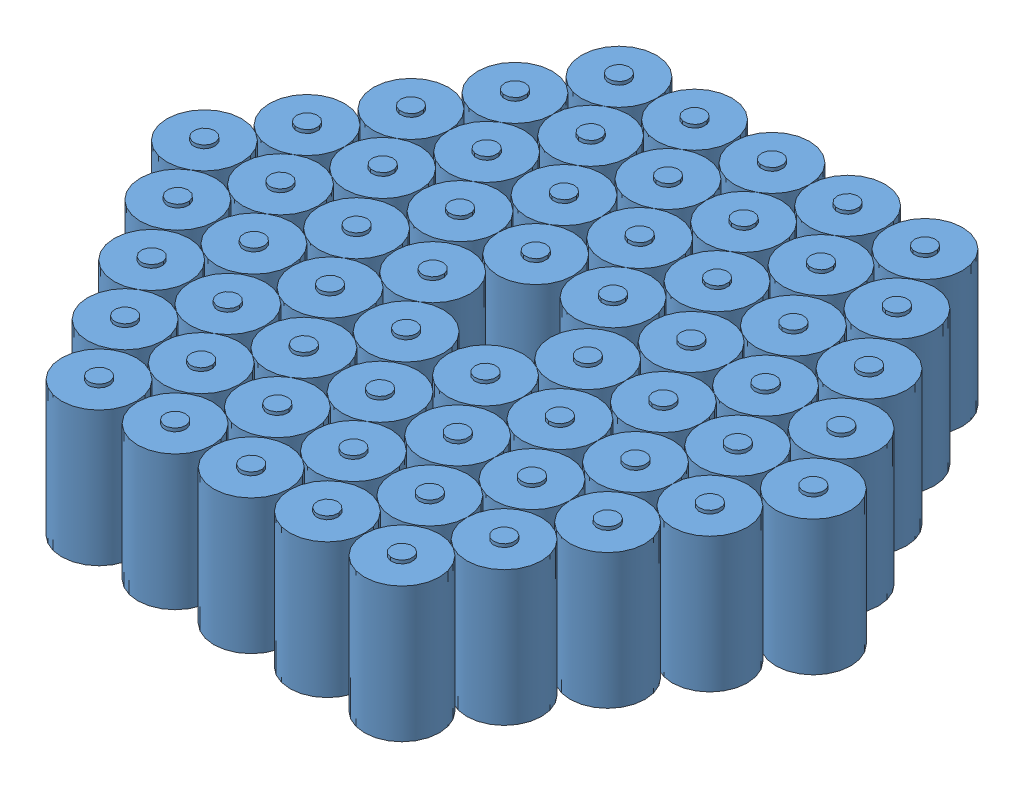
SolidWorks assembly MX1300 60 pack.SLDASM, configuration Default (file format 5000). Lengths in mm.
Overall size (352.05 63 346.25).
78 component instances, 1 part files, 11 mates.
Components (placement in the parent):
- MX1300 20 pack-1: MX1300 20 pack.SLDASM [Default] at (151.7205 0 -357.6328) x (0.5 0 -0.866025) z (0.866025 0 0.5) size (208.75 63 152.66)
  - MX1300 4 pack-1: MX1300 4 pack.SLDASM [Default] at (-237.9849 0 135.8963) size (138.32 63 34.2)
    - Duracell MX1300 Alk-1: Duracell MX1300 Alk.SLDPRT [Default] at (13.6671 0 17.1) size (34.2 63 34.2)
    - Duracell MX1300 Alk-2: Duracell MX1300 Alk.SLDPRT [Default] at (-21.0409 0 17.1) size (34.2 63 34.2)
    - Duracell MX1300 Alk-3: Duracell MX1300 Alk.SLDPRT [Default] at (-55.7489 0 17.1) size (34.2 63 34.2)
    - Duracell MX1300 Alk-4: Duracell MX1300 Alk.SLDPRT [Default] at (-90.4569 0 17.1) size (34.2 63 34.2)
  - MX1300 4 pack-2: MX1300 4 pack.SLDASM [Default] at (-255.8432 0 106.1351) size (138.32 63 34.2)
    - Duracell MX1300 Alk-1: Duracell MX1300 Alk.SLDPRT [Default] at (13.6671 0 17.1) size (34.2 63 34.2)
    - Duracell MX1300 Alk-2: Duracell MX1300 Alk.SLDPRT [Default] at (-21.0409 0 17.1) size (34.2 63 34.2)
    - Duracell MX1300 Alk-3: Duracell MX1300 Alk.SLDPRT [Default] at (-55.7489 0 17.1) size (34.2 63 34.2)
    - Duracell MX1300 Alk-4: Duracell MX1300 Alk.SLDPRT [Default] at (-90.4569 0 17.1) size (34.2 63 34.2)
  - MX1300 4 pack-3: MX1300 4 pack.SLDASM [Default] at (-273.1972 0 76.6652) size (138.32 63 34.2)
    - Duracell MX1300 Alk-1: Duracell MX1300 Alk.SLDPRT [Default] at (13.6671 0 17.1) size (34.2 63 34.2)
    - Duracell MX1300 Alk-2: Duracell MX1300 Alk.SLDPRT [Default] at (-21.0409 0 17.1) size (34.2 63 34.2)
    - Duracell MX1300 Alk-3: Duracell MX1300 Alk.SLDPRT [Default] at (-55.7489 0 17.1) size (34.2 63 34.2)
    - Duracell MX1300 Alk-4: Duracell MX1300 Alk.SLDPRT [Default] at (-90.4569 0 17.1) size (34.2 63 34.2)
  - MX1300 4 pack-4: MX1300 4 pack.SLDASM [Default] at (-291.0555 0 46.904) size (138.32 63 34.2)
    - Duracell MX1300 Alk-1: Duracell MX1300 Alk.SLDPRT [Default] at (13.6671 0 17.1) size (34.2 63 34.2)
    - Duracell MX1300 Alk-2: Duracell MX1300 Alk.SLDPRT [Default] at (-21.0409 0 17.1) size (34.2 63 34.2)
    - Duracell MX1300 Alk-3: Duracell MX1300 Alk.SLDPRT [Default] at (-55.7489 0 17.1) size (34.2 63 34.2)
    - Duracell MX1300 Alk-4: Duracell MX1300 Alk.SLDPRT [Default] at (-90.4569 0 17.1) size (34.2 63 34.2)
  - MX1300 4 pack-5: MX1300 4 pack.SLDASM [Default] at (-308.4095 0 17.434) size (138.32 63 34.2)
    - Duracell MX1300 Alk-1: Duracell MX1300 Alk.SLDPRT [Default] at (13.6671 0 17.1) size (34.2 63 34.2)
    - Duracell MX1300 Alk-2: Duracell MX1300 Alk.SLDPRT [Default] at (-21.0409 0 17.1) size (34.2 63 34.2)
    - Duracell MX1300 Alk-3: Duracell MX1300 Alk.SLDPRT [Default] at (-55.7489 0 17.1) size (34.2 63 34.2)
    - Duracell MX1300 Alk-4: Duracell MX1300 Alk.SLDPRT [Default] at (-90.4569 0 17.1) size (34.2 63 34.2)
- MX1300 20 pack-2: MX1300 20 pack.SLDASM [Default] at (-55.4976 0 -174.7254) x (-0.5 0 -0.866025) z (0.866025 0 -0.5) size (208.75 63 152.66)
  - MX1300 4 pack-1: MX1300 4 pack.SLDASM [Default] at (-237.9849 0 135.8963) size (138.32 63 34.2)
    - Duracell MX1300 Alk-1: Duracell MX1300 Alk.SLDPRT [Default] at (13.6671 0 17.1) size (34.2 63 34.2)
    - Duracell MX1300 Alk-2: Duracell MX1300 Alk.SLDPRT [Default] at (-21.0409 0 17.1) size (34.2 63 34.2)
    - Duracell MX1300 Alk-3: Duracell MX1300 Alk.SLDPRT [Default] at (-55.7489 0 17.1) size (34.2 63 34.2)
    - Duracell MX1300 Alk-4: Duracell MX1300 Alk.SLDPRT [Default] at (-90.4569 0 17.1) size (34.2 63 34.2)
  - MX1300 4 pack-2: MX1300 4 pack.SLDASM [Default] at (-255.8432 0 106.1351) size (138.32 63 34.2)
    - Duracell MX1300 Alk-1: Duracell MX1300 Alk.SLDPRT [Default] at (13.6671 0 17.1) size (34.2 63 34.2)
    - Duracell MX1300 Alk-2: Duracell MX1300 Alk.SLDPRT [Default] at (-21.0409 0 17.1) size (34.2 63 34.2)
    - Duracell MX1300 Alk-3: Duracell MX1300 Alk.SLDPRT [Default] at (-55.7489 0 17.1) size (34.2 63 34.2)
    - Duracell MX1300 Alk-4: Duracell MX1300 Alk.SLDPRT [Default] at (-90.4569 0 17.1) size (34.2 63 34.2)
  - MX1300 4 pack-3: MX1300 4 pack.SLDASM [Default] at (-273.1972 0 76.6652) size (138.32 63 34.2)
    - Duracell MX1300 Alk-1: Duracell MX1300 Alk.SLDPRT [Default] at (13.6671 0 17.1) size (34.2 63 34.2)
    - Duracell MX1300 Alk-2: Duracell MX1300 Alk.SLDPRT [Default] at (-21.0409 0 17.1) size (34.2 63 34.2)
    - Duracell MX1300 Alk-3: Duracell MX1300 Alk.SLDPRT [Default] at (-55.7489 0 17.1) size (34.2 63 34.2)
    - Duracell MX1300 Alk-4: Duracell MX1300 Alk.SLDPRT [Default] at (-90.4569 0 17.1) size (34.2 63 34.2)
  - MX1300 4 pack-4: MX1300 4 pack.SLDASM [Default] at (-291.0555 0 46.904) size (138.32 63 34.2)
    - Duracell MX1300 Alk-1: Duracell MX1300 Alk.SLDPRT [Default] at (13.6671 0 17.1) size (34.2 63 34.2)
    - Duracell MX1300 Alk-2: Duracell MX1300 Alk.SLDPRT [Default] at (-21.0409 0 17.1) size (34.2 63 34.2)
    - Duracell MX1300 Alk-3: Duracell MX1300 Alk.SLDPRT [Default] at (-55.7489 0 17.1) size (34.2 63 34.2)
    - Duracell MX1300 Alk-4: Duracell MX1300 Alk.SLDPRT [Default] at (-90.4569 0 17.1) size (34.2 63 34.2)
  - MX1300 4 pack-5: MX1300 4 pack.SLDASM [Default] at (-308.4095 0 17.434) size (138.32 63 34.2)
    - Duracell MX1300 Alk-1: Duracell MX1300 Alk.SLDPRT [Default] at (13.6671 0 17.1) size (34.2 63 34.2)
    - Duracell MX1300 Alk-2: Duracell MX1300 Alk.SLDPRT [Default] at (-21.0409 0 17.1) size (34.2 63 34.2)
    - Duracell MX1300 Alk-3: Duracell MX1300 Alk.SLDPRT [Default] at (-55.7489 0 17.1) size (34.2 63 34.2)
    - Duracell MX1300 Alk-4: Duracell MX1300 Alk.SLDPRT [Default] at (-90.4569 0 17.1) size (34.2 63 34.2)
- MX1300 20 pack-3: MX1300 20 pack.SLDASM [Default] at (363.7095 0 0) size (208.75 63 152.66)
  - MX1300 4 pack-1: MX1300 4 pack.SLDASM [Default] at (-237.9849 0 135.8963) size (138.32 63 34.2)
    - Duracell MX1300 Alk-1: Duracell MX1300 Alk.SLDPRT [Default] at (13.6671 0 17.1) size (34.2 63 34.2)
    - Duracell MX1300 Alk-2: Duracell MX1300 Alk.SLDPRT [Default] at (-21.0409 0 17.1) size (34.2 63 34.2)
    - Duracell MX1300 Alk-3: Duracell MX1300 Alk.SLDPRT [Default] at (-55.7489 0 17.1) size (34.2 63 34.2)
    - Duracell MX1300 Alk-4: Duracell MX1300 Alk.SLDPRT [Default] at (-90.4569 0 17.1) size (34.2 63 34.2)
  - MX1300 4 pack-2: MX1300 4 pack.SLDASM [Default] at (-255.8432 0 106.1351) size (138.32 63 34.2)
    - Duracell MX1300 Alk-1: Duracell MX1300 Alk.SLDPRT [Default] at (13.6671 0 17.1) size (34.2 63 34.2)
    - Duracell MX1300 Alk-2: Duracell MX1300 Alk.SLDPRT [Default] at (-21.0409 0 17.1) size (34.2 63 34.2)
    - Duracell MX1300 Alk-3: Duracell MX1300 Alk.SLDPRT [Default] at (-55.7489 0 17.1) size (34.2 63 34.2)
    - Duracell MX1300 Alk-4: Duracell MX1300 Alk.SLDPRT [Default] at (-90.4569 0 17.1) size (34.2 63 34.2)
  - MX1300 4 pack-3: MX1300 4 pack.SLDASM [Default] at (-273.1972 0 76.6652) size (138.32 63 34.2)
    - Duracell MX1300 Alk-1: Duracell MX1300 Alk.SLDPRT [Default] at (13.6671 0 17.1) size (34.2 63 34.2)
    - Duracell MX1300 Alk-2: Duracell MX1300 Alk.SLDPRT [Default] at (-21.0409 0 17.1) size (34.2 63 34.2)
    - Duracell MX1300 Alk-3: Duracell MX1300 Alk.SLDPRT [Default] at (-55.7489 0 17.1) size (34.2 63 34.2)
    - Duracell MX1300 Alk-4: Duracell MX1300 Alk.SLDPRT [Default] at (-90.4569 0 17.1) size (34.2 63 34.2)
  - MX1300 4 pack-4: MX1300 4 pack.SLDASM [Default] at (-291.0555 0 46.904) size (138.32 63 34.2)
    - Duracell MX1300 Alk-1: Duracell MX1300 Alk.SLDPRT [Default] at (13.6671 0 17.1) size (34.2 63 34.2)
    - Duracell MX1300 Alk-2: Duracell MX1300 Alk.SLDPRT [Default] at (-21.0409 0 17.1) size (34.2 63 34.2)
    - Duracell MX1300 Alk-3: Duracell MX1300 Alk.SLDPRT [Default] at (-55.7489 0 17.1) size (34.2 63 34.2)
    - Duracell MX1300 Alk-4: Duracell MX1300 Alk.SLDPRT [Default] at (-90.4569 0 17.1) size (34.2 63 34.2)
  - MX1300 4 pack-5: MX1300 4 pack.SLDASM [Default] at (-308.4095 0 17.434) size (138.32 63 34.2)
    - Duracell MX1300 Alk-1: Duracell MX1300 Alk.SLDPRT [Default] at (13.6671 0 17.1) size (34.2 63 34.2)
    - Duracell MX1300 Alk-2: Duracell MX1300 Alk.SLDPRT [Default] at (-21.0409 0 17.1) size (34.2 63 34.2)
    - Duracell MX1300 Alk-3: Duracell MX1300 Alk.SLDPRT [Default] at (-55.7489 0 17.1) size (34.2 63 34.2)
    - Duracell MX1300 Alk-4: Duracell MX1300 Alk.SLDPRT [Default] at (-90.4569 0 17.1) size (34.2 63 34.2)
Mates (geometry in assembly coordinates):
- Coincident1: coincident anti-aligned: plane of MX1300 20 pack-3/MX1300 4 pack-1/Duracell MX1300 Alk-1 through (139.3917 0 152.9963) normal (0 -1 0); plane of assembly
- Coincident2: coincident anti-aligned: plane of MX1300 20 pack-2/MX1300 4 pack-1/Duracell MX1300 Alk-4; plane of assembly
- Coincident3: coincident anti-aligned: plane of MX1300 20 pack-1/MX1300 4 pack-1/Duracell MX1300 Alk-1; plane of assembly
- Angle1: planar angle = 1.047198 rad aligned: plane of MX1300 20 pack-1; plane of assembly
- Angle2: planar angle = 1.047198 rad anti-aligned: plane of MX1300 20 pack-2; plane of assembly
- Parallel1: parallel aligned: plane of MX1300 20 pack-3; plane of assembly
- Distance1: distance = 0.254 mm: cylinder of assembly through (173.8429 61.5 153.436) axis (0 -1 0) radius 17.1; cylinder of MX1300 20 pack-3/MX1300 4 pack-1/Duracell MX1300 Alk-1 through (139.3917 61.5 152.9963) axis (0 -1 0) radius 17.1
- Distance2: distance = 0.254 mm: cylinder of MX1300 20 pack-1/MX1300 4 pack-1/Duracell MX1300 Alk-1 through (172.0602 61.5 -86.8698) axis (0 -1 0) radius 17.1; cylinder of MX1300 20 pack-2/MX1300 4 pack-1/Duracell MX1300 Alk-1 through (189.1599 61.5 -56.9586) axis (0 -1 0) radius 17.1
- Tangent4: tangent anti-aligned: cylinder of MX1300 20 pack-1/MX1300 4 pack-5/Duracell MX1300 Alk-4 through (-17.8054 61.5 5.0626) axis (0 -1 0) radius 17.1; cylinder of MX1300 20 pack-3/MX1300 4 pack-5/Duracell MX1300 Alk-4 through (-35.1569 61.5 34.534) axis (0 -1 0) radius 17.1
- Distance5: distance = 0.254 mm: cylinder of MX1300 20 pack-1/MX1300 4 pack-1/Duracell MX1300 Alk-2 through (154.7062 61.5 -56.8118) axis (0 -1 0) radius 17.1; cylinder of MX1300 20 pack-2/MX1300 4 pack-1/Duracell MX1300 Alk-1 through (189.1599 61.5 -56.9586) axis (0 -1 0) radius 17.1
- Coincident5: coincident aligned: plane of MX1300 20 pack-3; plane of assembly
